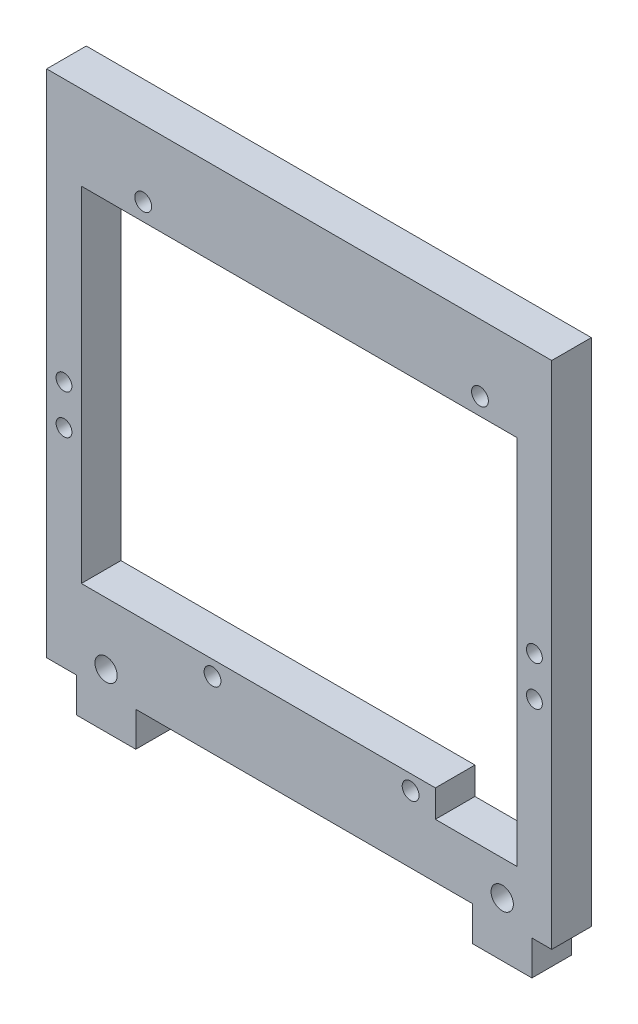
ISO-10303-21;
HEADER;
FILE_DESCRIPTION(('STEP AP214'),'2;1');
FILE_NAME('part.step','',(''),(''),'','','');
FILE_SCHEMA(('AUTOMOTIVE_DESIGN { 1 0 10303 214 1 1 1 1 }'));
ENDSEC;
DATA;
#1=APPLICATION_CONTEXT('core data for automotive mechanical design processes');
#2=APPLICATION_PROTOCOL_DEFINITION('international standard','automotive_design',2000,#1);
#3=PRODUCT_CONTEXT('',#1,'mechanical');
#4=PRODUCT('Part','Part','',(#3));
#5=PRODUCT_RELATED_PRODUCT_CATEGORY('part','',(#4));
#6=PRODUCT_DEFINITION_FORMATION('','',#4);
#7=PRODUCT_DEFINITION_CONTEXT('part definition',#1,'design');
#8=PRODUCT_DEFINITION('design','',#6,#7);
#9=PRODUCT_DEFINITION_SHAPE('','',#8);
#10=(LENGTH_UNIT() NAMED_UNIT(*) SI_UNIT(.MILLI.,.METRE.));
#11=(NAMED_UNIT(*) PLANE_ANGLE_UNIT() SI_UNIT($,.RADIAN.));
#12=(NAMED_UNIT(*) SI_UNIT($,.STERADIAN.) SOLID_ANGLE_UNIT());
#13=UNCERTAINTY_MEASURE_WITH_UNIT(LENGTH_MEASURE(1.E-05),#10,'distance_accuracy_value','');
#14=(GEOMETRIC_REPRESENTATION_CONTEXT(3) GLOBAL_UNCERTAINTY_ASSIGNED_CONTEXT((#13)) GLOBAL_UNIT_ASSIGNED_CONTEXT((#10,
#11,#12)) REPRESENTATION_CONTEXT('',''));
#15=CARTESIAN_POINT('',(0.,0.,0.));
#16=DIRECTION('',(0.,0.,1.));
#17=DIRECTION('',(1.,0.,0.));
#18=AXIS2_PLACEMENT_3D('',#15,#16,#17);
#19=CARTESIAN_POINT('',(0.,0.,8.));
#20=DIRECTION('',(0.,0.,1.));
#21=DIRECTION('',(1.,0.,0.));
#22=AXIS2_PLACEMENT_3D('',#19,#20,#21);
#23=PLANE('',#22);
#24=CARTESIAN_POINT('',(46.5,-15.,8.));
#25=DIRECTION('',(0.,0.,1.));
#26=DIRECTION('',(1.,0.,0.));
#27=AXIS2_PLACEMENT_3D('',#24,#25,#26);
#28=CIRCLE('',#27,1.6);
#29=CARTESIAN_POINT('',(48.1,-15.,8.));
#30=VERTEX_POINT('',#29);
#31=EDGE_CURVE('E642',#30,#30,#28,.T.);
#32=ORIENTED_EDGE('',*,*,#31,.F.);
#33=EDGE_LOOP('',(#32));
#34=FACE_BOUND('',#33,.T.);
#35=CARTESIAN_POINT('',(-48.5,-15.,8.));
#36=DIRECTION('',(0.,0.,1.));
#37=DIRECTION('',(1.,0.,0.));
#38=AXIS2_PLACEMENT_3D('',#35,#36,#37);
#39=CIRCLE('',#38,1.6);
#40=CARTESIAN_POINT('',(-46.9,-15.,8.));
#41=VERTEX_POINT('',#40);
#42=EDGE_CURVE('E654',#41,#41,#39,.T.);
#43=ORIENTED_EDGE('',*,*,#42,.F.);
#44=EDGE_LOOP('',(#43));
#45=FACE_BOUND('',#44,.T.);
#46=CARTESIAN_POINT('',(-40.,-53.,8.));
#47=DIRECTION('',(0.,0.,1.));
#48=DIRECTION('',(1.,0.,0.));
#49=AXIS2_PLACEMENT_3D('',#46,#47,#48);
#50=CIRCLE('',#49,2.25);
#51=CARTESIAN_POINT('',(-37.75,-53.,8.));
#52=VERTEX_POINT('',#51);
#53=EDGE_CURVE('E666',#52,#52,#50,.T.);
#54=ORIENTED_EDGE('',*,*,#53,.F.);
#55=EDGE_LOOP('',(#54));
#56=FACE_BOUND('',#55,.T.);
#57=CARTESIAN_POINT('',(-18.5,-43.5,8.));
#58=DIRECTION('',(0.,0.,1.));
#59=DIRECTION('',(1.,0.,0.));
#60=AXIS2_PLACEMENT_3D('',#57,#58,#59);
#61=CIRCLE('',#60,1.7);
#62=CARTESIAN_POINT('',(-16.8,-43.5,8.));
#63=VERTEX_POINT('',#62);
#64=EDGE_CURVE('E678',#63,#63,#61,.T.);
#65=ORIENTED_EDGE('',*,*,#64,.F.);
#66=EDGE_LOOP('',(#65));
#67=FACE_BOUND('',#66,.T.);
#68=CARTESIAN_POINT('',(-32.5,32.5,8.));
#69=DIRECTION('',(0.,0.,1.));
#70=DIRECTION('',(1.,0.,0.));
#71=AXIS2_PLACEMENT_3D('',#68,#69,#70);
#72=CIRCLE('',#71,1.7);
#73=CARTESIAN_POINT('',(-30.8,32.5,8.));
#74=VERTEX_POINT('',#73);
#75=EDGE_CURVE('E202',#74,#74,#72,.T.);
#76=ORIENTED_EDGE('',*,*,#75,.F.);
#77=EDGE_LOOP('',(#76));
#78=FACE_BOUND('',#77,.T.);
#79=DIRECTION('',(0.,-1.,0.));
#80=VECTOR('',#79,1.);
#81=CARTESIAN_POINT('',(-52.,46.,8.));
#82=LINE('',#81,#80);
#83=CARTESIAN_POINT('',(-52.,46.,8.));
#84=VERTEX_POINT('',#83);
#85=CARTESIAN_POINT('',(-52.,-57.,8.));
#86=VERTEX_POINT('',#85);
#87=EDGE_CURVE('E222',#84,#86,#82,.T.);
#88=ORIENTED_EDGE('',*,*,#87,.T.);
#89=DIRECTION('',(1.,0.,0.));
#90=VECTOR('',#89,1.);
#91=CARTESIAN_POINT('',(-52.,-57.,8.));
#92=LINE('',#91,#90);
#93=CARTESIAN_POINT('',(-46.,-57.,8.));
#94=VERTEX_POINT('',#93);
#95=EDGE_CURVE('E225',#86,#94,#92,.T.);
#96=ORIENTED_EDGE('',*,*,#95,.T.);
#97=DIRECTION('',(0.,-1.,0.));
#98=VECTOR('',#97,1.);
#99=CARTESIAN_POINT('',(-46.,-57.,8.));
#100=LINE('',#99,#98);
#101=CARTESIAN_POINT('',(-46.,-64.,8.));
#102=VERTEX_POINT('',#101);
#103=EDGE_CURVE('E228',#94,#102,#100,.T.);
#104=ORIENTED_EDGE('',*,*,#103,.T.);
#105=DIRECTION('',(1.,0.,0.));
#106=VECTOR('',#105,1.);
#107=CARTESIAN_POINT('',(-46.,-64.,8.));
#108=LINE('',#107,#106);
#109=CARTESIAN_POINT('',(-34.,-64.,8.));
#110=VERTEX_POINT('',#109);
#111=EDGE_CURVE('E230',#102,#110,#108,.T.);
#112=ORIENTED_EDGE('',*,*,#111,.T.);
#113=DIRECTION('',(0.,1.,0.));
#114=VECTOR('',#113,1.);
#115=CARTESIAN_POINT('',(-34.,-64.,8.));
#116=LINE('',#115,#114);
#117=CARTESIAN_POINT('',(-34.,-57.,8.));
#118=VERTEX_POINT('',#117);
#119=EDGE_CURVE('E232',#110,#118,#116,.T.);
#120=ORIENTED_EDGE('',*,*,#119,.T.);
#121=DIRECTION('',(1.,0.,0.));
#122=VECTOR('',#121,1.);
#123=CARTESIAN_POINT('',(-34.,-57.,8.));
#124=LINE('',#123,#122);
#125=CARTESIAN_POINT('',(34.,-57.,8.));
#126=VERTEX_POINT('',#125);
#127=EDGE_CURVE('E234',#118,#126,#124,.T.);
#128=ORIENTED_EDGE('',*,*,#127,.T.);
#129=DIRECTION('',(0.,-1.,0.));
#130=VECTOR('',#129,1.);
#131=CARTESIAN_POINT('',(34.,-57.,8.));
#132=LINE('',#131,#130);
#133=CARTESIAN_POINT('',(34.,-64.,8.));
#134=VERTEX_POINT('',#133);
#135=EDGE_CURVE('E236',#126,#134,#132,.T.);
#136=ORIENTED_EDGE('',*,*,#135,.T.);
#137=DIRECTION('',(1.,0.,0.));
#138=VECTOR('',#137,1.);
#139=CARTESIAN_POINT('',(34.,-64.,8.));
#140=LINE('',#139,#138);
#141=CARTESIAN_POINT('',(46.,-64.,8.));
#142=VERTEX_POINT('',#141);
#143=EDGE_CURVE('E238',#134,#142,#140,.T.);
#144=ORIENTED_EDGE('',*,*,#143,.T.);
#145=DIRECTION('',(0.,1.,0.));
#146=VECTOR('',#145,1.);
#147=CARTESIAN_POINT('',(46.,-64.,8.));
#148=LINE('',#147,#146);
#149=CARTESIAN_POINT('',(46.,-57.,8.));
#150=VERTEX_POINT('',#149);
#151=EDGE_CURVE('E240',#142,#150,#148,.T.);
#152=ORIENTED_EDGE('',*,*,#151,.T.);
#153=DIRECTION('',(1.,0.,0.));
#154=VECTOR('',#153,1.);
#155=CARTESIAN_POINT('',(46.,-57.,8.));
#156=LINE('',#155,#154);
#157=CARTESIAN_POINT('',(50.,-57.,8.));
#158=VERTEX_POINT('',#157);
#159=EDGE_CURVE('E242',#150,#158,#156,.T.);
#160=ORIENTED_EDGE('',*,*,#159,.T.);
#161=DIRECTION('',(0.,1.,0.));
#162=VECTOR('',#161,1.);
#163=CARTESIAN_POINT('',(50.,-57.,8.));
#164=LINE('',#163,#162);
#165=CARTESIAN_POINT('',(50.,46.,8.));
#166=VERTEX_POINT('',#165);
#167=EDGE_CURVE('E244',#158,#166,#164,.T.);
#168=ORIENTED_EDGE('',*,*,#167,.T.);
#169=DIRECTION('',(-1.,0.,0.));
#170=VECTOR('',#169,1.);
#171=CARTESIAN_POINT('',(50.,46.,8.));
#172=LINE('',#171,#170);
#173=EDGE_CURVE('E246',#166,#84,#172,.T.);
#174=ORIENTED_EDGE('',*,*,#173,.T.);
#175=EDGE_LOOP('',(#88,#96,#104,#112,#120,#128,#136,#144,#152,#160,#168,#174));
#176=FACE_BOUND('',#175,.T.);
#177=DIRECTION('',(1.,0.,0.));
#178=VECTOR('',#177,1.);
#179=CARTESIAN_POINT('',(-45.,-40.5,8.));
#180=LINE('',#179,#178);
#181=CARTESIAN_POINT('',(-45.,-40.5,8.));
#182=VERTEX_POINT('',#181);
#183=CARTESIAN_POINT('',(26.5,-40.5,8.));
#184=VERTEX_POINT('',#183);
#185=EDGE_CURVE('E176',#182,#184,#180,.T.);
#186=ORIENTED_EDGE('',*,*,#185,.F.);
#187=DIRECTION('',(0.,-1.,0.));
#188=VECTOR('',#187,1.);
#189=CARTESIAN_POINT('',(-45.,29.,8.));
#190=LINE('',#189,#188);
#191=CARTESIAN_POINT('',(-45.,29.,8.));
#192=VERTEX_POINT('',#191);
#193=EDGE_CURVE('E168',#192,#182,#190,.T.);
#194=ORIENTED_EDGE('',*,*,#193,.F.);
#195=DIRECTION('',(-1.,0.,0.));
#196=VECTOR('',#195,1.);
#197=CARTESIAN_POINT('',(43.,29.,8.));
#198=LINE('',#197,#196);
#199=CARTESIAN_POINT('',(43.,29.,8.));
#200=VERTEX_POINT('',#199);
#201=EDGE_CURVE('E199',#200,#192,#198,.T.);
#202=ORIENTED_EDGE('',*,*,#201,.F.);
#203=DIRECTION('',(0.,1.,0.));
#204=VECTOR('',#203,1.);
#205=CARTESIAN_POINT('',(43.,-46.,8.));
#206=LINE('',#205,#204);
#207=CARTESIAN_POINT('',(43.,-46.,8.));
#208=VERTEX_POINT('',#207);
#209=EDGE_CURVE('E197',#208,#200,#206,.T.);
#210=ORIENTED_EDGE('',*,*,#209,.F.);
#211=DIRECTION('',(1.,0.,0.));
#212=VECTOR('',#211,1.);
#213=CARTESIAN_POINT('',(26.5,-46.,8.));
#214=LINE('',#213,#212);
#215=CARTESIAN_POINT('',(26.5,-46.,8.));
#216=VERTEX_POINT('',#215);
#217=EDGE_CURVE('E192',#216,#208,#214,.T.);
#218=ORIENTED_EDGE('',*,*,#217,.F.);
#219=DIRECTION('',(0.,-1.,0.));
#220=VECTOR('',#219,1.);
#221=CARTESIAN_POINT('',(26.5,-40.5,8.));
#222=LINE('',#221,#220);
#223=EDGE_CURVE('E190',#184,#216,#222,.T.);
#224=ORIENTED_EDGE('',*,*,#223,.F.);
#225=EDGE_LOOP('',(#186,#194,#202,#210,#218,#224));
#226=FACE_BOUND('',#225,.T.);
#227=CARTESIAN_POINT('',(35.5,32.5,8.));
#228=DIRECTION('',(0.,0.,1.));
#229=DIRECTION('',(1.,0.,0.));
#230=AXIS2_PLACEMENT_3D('',#227,#228,#229);
#231=CIRCLE('',#230,1.7);
#232=CARTESIAN_POINT('',(37.2,32.5,8.));
#233=VERTEX_POINT('',#232);
#234=EDGE_CURVE('E684',#233,#233,#231,.T.);
#235=ORIENTED_EDGE('',*,*,#234,.F.);
#236=EDGE_LOOP('',(#235));
#237=FACE_BOUND('',#236,.T.);
#238=CARTESIAN_POINT('',(21.5,-43.5,8.));
#239=DIRECTION('',(0.,0.,1.));
#240=DIRECTION('',(1.,0.,0.));
#241=AXIS2_PLACEMENT_3D('',#238,#239,#240);
#242=CIRCLE('',#241,1.7);
#243=CARTESIAN_POINT('',(23.2,-43.5,8.));
#244=VERTEX_POINT('',#243);
#245=EDGE_CURVE('E672',#244,#244,#242,.T.);
#246=ORIENTED_EDGE('',*,*,#245,.F.);
#247=EDGE_LOOP('',(#246));
#248=FACE_BOUND('',#247,.T.);
#249=CARTESIAN_POINT('',(40.,-53.,8.));
#250=DIRECTION('',(0.,0.,1.));
#251=DIRECTION('',(1.,0.,0.));
#252=AXIS2_PLACEMENT_3D('',#249,#250,#251);
#253=CIRCLE('',#252,2.25);
#254=CARTESIAN_POINT('',(42.25,-53.,8.));
#255=VERTEX_POINT('',#254);
#256=EDGE_CURVE('E660',#255,#255,#253,.T.);
#257=ORIENTED_EDGE('',*,*,#256,.F.);
#258=EDGE_LOOP('',(#257));
#259=FACE_BOUND('',#258,.T.);
#260=CARTESIAN_POINT('',(-48.5,-7.,8.));
#261=DIRECTION('',(0.,0.,1.));
#262=DIRECTION('',(1.,0.,0.));
#263=AXIS2_PLACEMENT_3D('',#260,#261,#262);
#264=CIRCLE('',#263,1.6);
#265=CARTESIAN_POINT('',(-46.9,-7.,8.));
#266=VERTEX_POINT('',#265);
#267=EDGE_CURVE('E648',#266,#266,#264,.T.);
#268=ORIENTED_EDGE('',*,*,#267,.F.);
#269=EDGE_LOOP('',(#268));
#270=FACE_BOUND('',#269,.T.);
#271=CARTESIAN_POINT('',(46.5,-7.,8.));
#272=DIRECTION('',(0.,0.,1.));
#273=DIRECTION('',(1.,0.,0.));
#274=AXIS2_PLACEMENT_3D('',#271,#272,#273);
#275=CIRCLE('',#274,1.6);
#276=CARTESIAN_POINT('',(48.1,-7.,8.));
#277=VERTEX_POINT('',#276);
#278=EDGE_CURVE('E633',#277,#277,#275,.T.);
#279=ORIENTED_EDGE('',*,*,#278,.F.);
#280=EDGE_LOOP('',(#279));
#281=FACE_BOUND('',#280,.T.);
#282=ADVANCED_FACE('F43',(#34,#45,#56,#67,#78,#176,#226,#237,#248,#259,#270,#281),#23,.T.);
#283=CARTESIAN_POINT('',(0.,0.,0.));
#284=DIRECTION('',(0.,0.,1.));
#285=DIRECTION('',(1.,0.,0.));
#286=AXIS2_PLACEMENT_3D('',#283,#284,#285);
#287=PLANE('',#286);
#288=DIRECTION('',(0.,-1.,0.));
#289=VECTOR('',#288,1.);
#290=CARTESIAN_POINT('',(-52.,46.,0.));
#291=LINE('',#290,#289);
#292=CARTESIAN_POINT('',(-52.,46.,0.));
#293=VERTEX_POINT('',#292);
#294=CARTESIAN_POINT('',(-52.,-57.,0.));
#295=VERTEX_POINT('',#294);
#296=EDGE_CURVE('E184',#293,#295,#291,.T.);
#297=ORIENTED_EDGE('',*,*,#296,.F.);
#298=DIRECTION('',(-1.,0.,0.));
#299=VECTOR('',#298,1.);
#300=CARTESIAN_POINT('',(50.,46.,0.));
#301=LINE('',#300,#299);
#302=CARTESIAN_POINT('',(50.,46.,0.));
#303=VERTEX_POINT('',#302);
#304=EDGE_CURVE('E226',#303,#293,#301,.T.);
#305=ORIENTED_EDGE('',*,*,#304,.F.);
#306=DIRECTION('',(0.,1.,0.));
#307=VECTOR('',#306,1.);
#308=CARTESIAN_POINT('',(50.,-57.,0.));
#309=LINE('',#308,#307);
#310=CARTESIAN_POINT('',(50.,-57.,0.));
#311=VERTEX_POINT('',#310);
#312=EDGE_CURVE('E269',#311,#303,#309,.T.);
#313=ORIENTED_EDGE('',*,*,#312,.F.);
#314=DIRECTION('',(1.,0.,0.));
#315=VECTOR('',#314,1.);
#316=CARTESIAN_POINT('',(46.,-57.,0.));
#317=LINE('',#316,#315);
#318=CARTESIAN_POINT('',(46.,-57.,0.));
#319=VERTEX_POINT('',#318);
#320=EDGE_CURVE('E267',#319,#311,#317,.T.);
#321=ORIENTED_EDGE('',*,*,#320,.F.);
#322=DIRECTION('',(0.,1.,0.));
#323=VECTOR('',#322,1.);
#324=CARTESIAN_POINT('',(46.,-64.,0.));
#325=LINE('',#324,#323);
#326=CARTESIAN_POINT('',(46.,-64.,0.));
#327=VERTEX_POINT('',#326);
#328=EDGE_CURVE('E265',#327,#319,#325,.T.);
#329=ORIENTED_EDGE('',*,*,#328,.F.);
#330=DIRECTION('',(1.,0.,0.));
#331=VECTOR('',#330,1.);
#332=CARTESIAN_POINT('',(34.,-64.,0.));
#333=LINE('',#332,#331);
#334=CARTESIAN_POINT('',(34.,-64.,0.));
#335=VERTEX_POINT('',#334);
#336=EDGE_CURVE('E263',#335,#327,#333,.T.);
#337=ORIENTED_EDGE('',*,*,#336,.F.);
#338=DIRECTION('',(0.,-1.,0.));
#339=VECTOR('',#338,1.);
#340=CARTESIAN_POINT('',(34.,-57.,0.));
#341=LINE('',#340,#339);
#342=CARTESIAN_POINT('',(34.,-57.,0.));
#343=VERTEX_POINT('',#342);
#344=EDGE_CURVE('E261',#343,#335,#341,.T.);
#345=ORIENTED_EDGE('',*,*,#344,.F.);
#346=DIRECTION('',(1.,0.,0.));
#347=VECTOR('',#346,1.);
#348=CARTESIAN_POINT('',(-34.,-57.,0.));
#349=LINE('',#348,#347);
#350=CARTESIAN_POINT('',(-34.,-57.,0.));
#351=VERTEX_POINT('',#350);
#352=EDGE_CURVE('E259',#351,#343,#349,.T.);
#353=ORIENTED_EDGE('',*,*,#352,.F.);
#354=DIRECTION('',(0.,1.,0.));
#355=VECTOR('',#354,1.);
#356=CARTESIAN_POINT('',(-34.,-64.,0.));
#357=LINE('',#356,#355);
#358=CARTESIAN_POINT('',(-34.,-64.,0.));
#359=VERTEX_POINT('',#358);
#360=EDGE_CURVE('E257',#359,#351,#357,.T.);
#361=ORIENTED_EDGE('',*,*,#360,.F.);
#362=DIRECTION('',(1.,0.,0.));
#363=VECTOR('',#362,1.);
#364=CARTESIAN_POINT('',(-46.,-64.,0.));
#365=LINE('',#364,#363);
#366=CARTESIAN_POINT('',(-46.,-64.,0.));
#367=VERTEX_POINT('',#366);
#368=EDGE_CURVE('E255',#367,#359,#365,.T.);
#369=ORIENTED_EDGE('',*,*,#368,.F.);
#370=DIRECTION('',(0.,-1.,0.));
#371=VECTOR('',#370,1.);
#372=CARTESIAN_POINT('',(-46.,-57.,0.));
#373=LINE('',#372,#371);
#374=CARTESIAN_POINT('',(-46.,-57.,0.));
#375=VERTEX_POINT('',#374);
#376=EDGE_CURVE('E253',#375,#367,#373,.T.);
#377=ORIENTED_EDGE('',*,*,#376,.F.);
#378=DIRECTION('',(1.,0.,0.));
#379=VECTOR('',#378,1.);
#380=CARTESIAN_POINT('',(-52.,-57.,0.));
#381=LINE('',#380,#379);
#382=EDGE_CURVE('E251',#295,#375,#381,.T.);
#383=ORIENTED_EDGE('',*,*,#382,.F.);
#384=EDGE_LOOP('',(#297,#305,#313,#321,#329,#337,#345,#353,#361,#369,#377,#383));
#385=FACE_BOUND('',#384,.T.);
#386=DIRECTION('',(0.,-1.,0.));
#387=VECTOR('',#386,1.);
#388=CARTESIAN_POINT('',(-45.,29.,0.));
#389=LINE('',#388,#387);
#390=CARTESIAN_POINT('',(-45.,29.,0.));
#391=VERTEX_POINT('',#390);
#392=CARTESIAN_POINT('',(-45.,-40.5,0.));
#393=VERTEX_POINT('',#392);
#394=EDGE_CURVE('E66',#391,#393,#389,.T.);
#395=ORIENTED_EDGE('',*,*,#394,.T.);
#396=DIRECTION('',(1.,0.,0.));
#397=VECTOR('',#396,1.);
#398=CARTESIAN_POINT('',(-45.,-40.5,0.));
#399=LINE('',#398,#397);
#400=CARTESIAN_POINT('',(26.5,-40.5,0.));
#401=VERTEX_POINT('',#400);
#402=EDGE_CURVE('E183',#393,#401,#399,.T.);
#403=ORIENTED_EDGE('',*,*,#402,.T.);
#404=DIRECTION('',(0.,-1.,0.));
#405=VECTOR('',#404,1.);
#406=CARTESIAN_POINT('',(26.5,-40.5,0.));
#407=LINE('',#406,#405);
#408=CARTESIAN_POINT('',(26.5,-46.,0.));
#409=VERTEX_POINT('',#408);
#410=EDGE_CURVE('E204',#401,#409,#407,.T.);
#411=ORIENTED_EDGE('',*,*,#410,.T.);
#412=DIRECTION('',(1.,0.,0.));
#413=VECTOR('',#412,1.);
#414=CARTESIAN_POINT('',(26.5,-46.,0.));
#415=LINE('',#414,#413);
#416=CARTESIAN_POINT('',(43.,-46.,0.));
#417=VERTEX_POINT('',#416);
#418=EDGE_CURVE('E207',#409,#417,#415,.T.);
#419=ORIENTED_EDGE('',*,*,#418,.T.);
#420=DIRECTION('',(0.,1.,0.));
#421=VECTOR('',#420,1.);
#422=CARTESIAN_POINT('',(43.,-46.,0.));
#423=LINE('',#422,#421);
#424=CARTESIAN_POINT('',(43.,29.,0.));
#425=VERTEX_POINT('',#424);
#426=EDGE_CURVE('E210',#417,#425,#423,.T.);
#427=ORIENTED_EDGE('',*,*,#426,.T.);
#428=DIRECTION('',(-1.,0.,0.));
#429=VECTOR('',#428,1.);
#430=CARTESIAN_POINT('',(43.,29.,0.));
#431=LINE('',#430,#429);
#432=EDGE_CURVE('E177',#425,#391,#431,.T.);
#433=ORIENTED_EDGE('',*,*,#432,.T.);
#434=EDGE_LOOP('',(#395,#403,#411,#419,#427,#433));
#435=FACE_BOUND('',#434,.T.);
#436=CARTESIAN_POINT('',(-32.5,32.5,0.));
#437=DIRECTION('',(0.,0.,1.));
#438=DIRECTION('',(1.,0.,0.));
#439=AXIS2_PLACEMENT_3D('',#436,#437,#438);
#440=CIRCLE('',#439,1.7);
#441=CARTESIAN_POINT('',(-30.8,32.5,0.));
#442=VERTEX_POINT('',#441);
#443=EDGE_CURVE('E687',#442,#442,#440,.T.);
#444=ORIENTED_EDGE('',*,*,#443,.T.);
#445=EDGE_LOOP('',(#444));
#446=FACE_BOUND('',#445,.T.);
#447=CARTESIAN_POINT('',(35.5,32.5,0.));
#448=DIRECTION('',(0.,0.,1.));
#449=DIRECTION('',(1.,0.,0.));
#450=AXIS2_PLACEMENT_3D('',#447,#448,#449);
#451=CIRCLE('',#450,1.7);
#452=CARTESIAN_POINT('',(37.2,32.5,0.));
#453=VERTEX_POINT('',#452);
#454=EDGE_CURVE('E681',#453,#453,#451,.T.);
#455=ORIENTED_EDGE('',*,*,#454,.T.);
#456=EDGE_LOOP('',(#455));
#457=FACE_BOUND('',#456,.T.);
#458=CARTESIAN_POINT('',(-18.5,-43.5,0.));
#459=DIRECTION('',(0.,0.,1.));
#460=DIRECTION('',(1.,0.,0.));
#461=AXIS2_PLACEMENT_3D('',#458,#459,#460);
#462=CIRCLE('',#461,1.7);
#463=CARTESIAN_POINT('',(-16.8,-43.5,0.));
#464=VERTEX_POINT('',#463);
#465=EDGE_CURVE('E675',#464,#464,#462,.T.);
#466=ORIENTED_EDGE('',*,*,#465,.T.);
#467=EDGE_LOOP('',(#466));
#468=FACE_BOUND('',#467,.T.);
#469=CARTESIAN_POINT('',(21.5,-43.5,0.));
#470=DIRECTION('',(0.,0.,1.));
#471=DIRECTION('',(1.,0.,0.));
#472=AXIS2_PLACEMENT_3D('',#469,#470,#471);
#473=CIRCLE('',#472,1.7);
#474=CARTESIAN_POINT('',(23.2,-43.5,0.));
#475=VERTEX_POINT('',#474);
#476=EDGE_CURVE('E669',#475,#475,#473,.T.);
#477=ORIENTED_EDGE('',*,*,#476,.T.);
#478=EDGE_LOOP('',(#477));
#479=FACE_BOUND('',#478,.T.);
#480=CARTESIAN_POINT('',(-40.,-53.,0.));
#481=DIRECTION('',(0.,0.,1.));
#482=DIRECTION('',(1.,0.,0.));
#483=AXIS2_PLACEMENT_3D('',#480,#481,#482);
#484=CIRCLE('',#483,2.25);
#485=CARTESIAN_POINT('',(-37.75,-53.,0.));
#486=VERTEX_POINT('',#485);
#487=EDGE_CURVE('E663',#486,#486,#484,.T.);
#488=ORIENTED_EDGE('',*,*,#487,.T.);
#489=EDGE_LOOP('',(#488));
#490=FACE_BOUND('',#489,.T.);
#491=CARTESIAN_POINT('',(40.,-53.,0.));
#492=DIRECTION('',(0.,0.,1.));
#493=DIRECTION('',(1.,0.,0.));
#494=AXIS2_PLACEMENT_3D('',#491,#492,#493);
#495=CIRCLE('',#494,2.25);
#496=CARTESIAN_POINT('',(42.25,-53.,0.));
#497=VERTEX_POINT('',#496);
#498=EDGE_CURVE('E657',#497,#497,#495,.T.);
#499=ORIENTED_EDGE('',*,*,#498,.T.);
#500=EDGE_LOOP('',(#499));
#501=FACE_BOUND('',#500,.T.);
#502=CARTESIAN_POINT('',(-48.5,-15.,0.));
#503=DIRECTION('',(0.,0.,1.));
#504=DIRECTION('',(1.,0.,0.));
#505=AXIS2_PLACEMENT_3D('',#502,#503,#504);
#506=CIRCLE('',#505,1.6);
#507=CARTESIAN_POINT('',(-46.9,-15.,0.));
#508=VERTEX_POINT('',#507);
#509=EDGE_CURVE('E651',#508,#508,#506,.T.);
#510=ORIENTED_EDGE('',*,*,#509,.T.);
#511=EDGE_LOOP('',(#510));
#512=FACE_BOUND('',#511,.T.);
#513=CARTESIAN_POINT('',(-48.5,-7.,0.));
#514=DIRECTION('',(0.,0.,1.));
#515=DIRECTION('',(1.,0.,0.));
#516=AXIS2_PLACEMENT_3D('',#513,#514,#515);
#517=CIRCLE('',#516,1.6);
#518=CARTESIAN_POINT('',(-46.9,-7.,0.));
#519=VERTEX_POINT('',#518);
#520=EDGE_CURVE('E645',#519,#519,#517,.T.);
#521=ORIENTED_EDGE('',*,*,#520,.T.);
#522=EDGE_LOOP('',(#521));
#523=FACE_BOUND('',#522,.T.);
#524=CARTESIAN_POINT('',(46.5,-15.,0.));
#525=DIRECTION('',(0.,0.,1.));
#526=DIRECTION('',(1.,0.,0.));
#527=AXIS2_PLACEMENT_3D('',#524,#525,#526);
#528=CIRCLE('',#527,1.6);
#529=CARTESIAN_POINT('',(48.1,-15.,0.));
#530=VERTEX_POINT('',#529);
#531=EDGE_CURVE('E639',#530,#530,#528,.T.);
#532=ORIENTED_EDGE('',*,*,#531,.T.);
#533=EDGE_LOOP('',(#532));
#534=FACE_BOUND('',#533,.T.);
#535=CARTESIAN_POINT('',(46.5,-7.,0.));
#536=DIRECTION('',(0.,0.,1.));
#537=DIRECTION('',(1.,0.,0.));
#538=AXIS2_PLACEMENT_3D('',#535,#536,#537);
#539=CIRCLE('',#538,1.6);
#540=CARTESIAN_POINT('',(48.1,-7.,0.));
#541=VERTEX_POINT('',#540);
#542=EDGE_CURVE('E636',#541,#541,#539,.T.);
#543=ORIENTED_EDGE('',*,*,#542,.T.);
#544=EDGE_LOOP('',(#543));
#545=FACE_BOUND('',#544,.T.);
#546=ADVANCED_FACE('F311',(#385,#435,#446,#457,#468,#479,#490,#501,#512,#523,#534,#545),#287,.F.);
#547=CARTESIAN_POINT('',(-52.,46.,8.));
#548=DIRECTION('',(1.,0.,0.));
#549=DIRECTION('',(0.,0.,-1.));
#550=AXIS2_PLACEMENT_3D('',#547,#548,#549);
#551=PLANE('',#550);
#552=ORIENTED_EDGE('',*,*,#296,.T.);
#553=DIRECTION('',(0.,0.,-1.));
#554=VECTOR('',#553,1.);
#555=CARTESIAN_POINT('',(-52.,-57.,8.));
#556=LINE('',#555,#554);
#557=EDGE_CURVE('E11',#86,#295,#556,.T.);
#558=ORIENTED_EDGE('',*,*,#557,.F.);
#559=ORIENTED_EDGE('',*,*,#87,.F.);
#560=DIRECTION('',(0.,0.,-1.));
#561=VECTOR('',#560,1.);
#562=CARTESIAN_POINT('',(-52.,46.,8.));
#563=LINE('',#562,#561);
#564=EDGE_CURVE('E248',#84,#293,#563,.T.);
#565=ORIENTED_EDGE('',*,*,#564,.T.);
#566=EDGE_LOOP('',(#552,#558,#559,#565));
#567=FACE_BOUND('',#566,.T.);
#568=ADVANCED_FACE('F45',(#567),#551,.F.);
#569=CARTESIAN_POINT('',(-52.,-57.,8.));
#570=DIRECTION('',(0.,1.,0.));
#571=DIRECTION('',(0.,0.,1.));
#572=AXIS2_PLACEMENT_3D('',#569,#570,#571);
#573=PLANE('',#572);
#574=ORIENTED_EDGE('',*,*,#382,.T.);
#575=DIRECTION('',(0.,0.,-1.));
#576=VECTOR('',#575,1.);
#577=CARTESIAN_POINT('',(-46.,-57.,8.));
#578=LINE('',#577,#576);
#579=EDGE_CURVE('E51',#94,#375,#578,.T.);
#580=ORIENTED_EDGE('',*,*,#579,.F.);
#581=ORIENTED_EDGE('',*,*,#95,.F.);
#582=ORIENTED_EDGE('',*,*,#557,.T.);
#583=EDGE_LOOP('',(#574,#580,#581,#582));
#584=FACE_BOUND('',#583,.T.);
#585=ADVANCED_FACE('F328',(#584),#573,.F.);
#586=CARTESIAN_POINT('',(-46.,-57.,8.));
#587=DIRECTION('',(1.,0.,0.));
#588=DIRECTION('',(0.,0.,-1.));
#589=AXIS2_PLACEMENT_3D('',#586,#587,#588);
#590=PLANE('',#589);
#591=ORIENTED_EDGE('',*,*,#376,.T.);
#592=DIRECTION('',(0.,0.,-1.));
#593=VECTOR('',#592,1.);
#594=CARTESIAN_POINT('',(-46.,-64.,8.));
#595=LINE('',#594,#593);
#596=EDGE_CURVE('E298',#102,#367,#595,.T.);
#597=ORIENTED_EDGE('',*,*,#596,.F.);
#598=ORIENTED_EDGE('',*,*,#103,.F.);
#599=ORIENTED_EDGE('',*,*,#579,.T.);
#600=EDGE_LOOP('',(#591,#597,#598,#599));
#601=FACE_BOUND('',#600,.T.);
#602=ADVANCED_FACE('F305',(#601),#590,.F.);
#603=CARTESIAN_POINT('',(-46.,-64.,8.));
#604=DIRECTION('',(0.,1.,0.));
#605=DIRECTION('',(0.,0.,1.));
#606=AXIS2_PLACEMENT_3D('',#603,#604,#605);
#607=PLANE('',#606);
#608=ORIENTED_EDGE('',*,*,#368,.T.);
#609=DIRECTION('',(0.,0.,-1.));
#610=VECTOR('',#609,1.);
#611=CARTESIAN_POINT('',(-34.,-64.,8.));
#612=LINE('',#611,#610);
#613=EDGE_CURVE('E295',#110,#359,#612,.T.);
#614=ORIENTED_EDGE('',*,*,#613,.F.);
#615=ORIENTED_EDGE('',*,*,#111,.F.);
#616=ORIENTED_EDGE('',*,*,#596,.T.);
#617=EDGE_LOOP('',(#608,#614,#615,#616));
#618=FACE_BOUND('',#617,.T.);
#619=ADVANCED_FACE('F317',(#618),#607,.F.);
#620=CARTESIAN_POINT('',(-34.,-64.,8.));
#621=DIRECTION('',(-1.,0.,0.));
#622=DIRECTION('',(0.,0.,1.));
#623=AXIS2_PLACEMENT_3D('',#620,#621,#622);
#624=PLANE('',#623);
#625=ORIENTED_EDGE('',*,*,#360,.T.);
#626=DIRECTION('',(0.,0.,-1.));
#627=VECTOR('',#626,1.);
#628=CARTESIAN_POINT('',(-34.,-57.,8.));
#629=LINE('',#628,#627);
#630=EDGE_CURVE('E292',#118,#351,#629,.T.);
#631=ORIENTED_EDGE('',*,*,#630,.F.);
#632=ORIENTED_EDGE('',*,*,#119,.F.);
#633=ORIENTED_EDGE('',*,*,#613,.T.);
#634=EDGE_LOOP('',(#625,#631,#632,#633));
#635=FACE_BOUND('',#634,.T.);
#636=ADVANCED_FACE('F321',(#635),#624,.F.);
#637=CARTESIAN_POINT('',(-34.,-57.,8.));
#638=DIRECTION('',(0.,1.,0.));
#639=DIRECTION('',(0.,0.,1.));
#640=AXIS2_PLACEMENT_3D('',#637,#638,#639);
#641=PLANE('',#640);
#642=ORIENTED_EDGE('',*,*,#352,.T.);
#643=DIRECTION('',(0.,0.,-1.));
#644=VECTOR('',#643,1.);
#645=CARTESIAN_POINT('',(34.,-57.,8.));
#646=LINE('',#645,#644);
#647=EDGE_CURVE('E289',#126,#343,#646,.T.);
#648=ORIENTED_EDGE('',*,*,#647,.F.);
#649=ORIENTED_EDGE('',*,*,#127,.F.);
#650=ORIENTED_EDGE('',*,*,#630,.T.);
#651=EDGE_LOOP('',(#642,#648,#649,#650));
#652=FACE_BOUND('',#651,.T.);
#653=ADVANCED_FACE('F361',(#652),#641,.F.);
#654=CARTESIAN_POINT('',(34.,-57.,8.));
#655=DIRECTION('',(1.,0.,0.));
#656=DIRECTION('',(0.,0.,-1.));
#657=AXIS2_PLACEMENT_3D('',#654,#655,#656);
#658=PLANE('',#657);
#659=ORIENTED_EDGE('',*,*,#344,.T.);
#660=DIRECTION('',(0.,0.,-1.));
#661=VECTOR('',#660,1.);
#662=CARTESIAN_POINT('',(34.,-64.,8.));
#663=LINE('',#662,#661);
#664=EDGE_CURVE('E286',#134,#335,#663,.T.);
#665=ORIENTED_EDGE('',*,*,#664,.F.);
#666=ORIENTED_EDGE('',*,*,#135,.F.);
#667=ORIENTED_EDGE('',*,*,#647,.T.);
#668=EDGE_LOOP('',(#659,#665,#666,#667));
#669=FACE_BOUND('',#668,.T.);
#670=ADVANCED_FACE('F359',(#669),#658,.F.);
#671=CARTESIAN_POINT('',(34.,-64.,8.));
#672=DIRECTION('',(0.,1.,0.));
#673=DIRECTION('',(0.,0.,1.));
#674=AXIS2_PLACEMENT_3D('',#671,#672,#673);
#675=PLANE('',#674);
#676=ORIENTED_EDGE('',*,*,#336,.T.);
#677=DIRECTION('',(0.,0.,-1.));
#678=VECTOR('',#677,1.);
#679=CARTESIAN_POINT('',(46.,-64.,8.));
#680=LINE('',#679,#678);
#681=EDGE_CURVE('E283',#142,#327,#680,.T.);
#682=ORIENTED_EDGE('',*,*,#681,.F.);
#683=ORIENTED_EDGE('',*,*,#143,.F.);
#684=ORIENTED_EDGE('',*,*,#664,.T.);
#685=EDGE_LOOP('',(#676,#682,#683,#684));
#686=FACE_BOUND('',#685,.T.);
#687=ADVANCED_FACE('F355',(#686),#675,.F.);
#688=CARTESIAN_POINT('',(46.,-64.,8.));
#689=DIRECTION('',(-1.,0.,0.));
#690=DIRECTION('',(0.,0.,1.));
#691=AXIS2_PLACEMENT_3D('',#688,#689,#690);
#692=PLANE('',#691);
#693=ORIENTED_EDGE('',*,*,#328,.T.);
#694=DIRECTION('',(0.,0.,-1.));
#695=VECTOR('',#694,1.);
#696=CARTESIAN_POINT('',(46.,-57.,8.));
#697=LINE('',#696,#695);
#698=EDGE_CURVE('E280',#150,#319,#697,.T.);
#699=ORIENTED_EDGE('',*,*,#698,.F.);
#700=ORIENTED_EDGE('',*,*,#151,.F.);
#701=ORIENTED_EDGE('',*,*,#681,.T.);
#702=EDGE_LOOP('',(#693,#699,#700,#701));
#703=FACE_BOUND('',#702,.T.);
#704=ADVANCED_FACE('F350',(#703),#692,.F.);
#705=CARTESIAN_POINT('',(46.,-57.,8.));
#706=DIRECTION('',(0.,1.,0.));
#707=DIRECTION('',(0.,0.,1.));
#708=AXIS2_PLACEMENT_3D('',#705,#706,#707);
#709=PLANE('',#708);
#710=ORIENTED_EDGE('',*,*,#320,.T.);
#711=DIRECTION('',(0.,0.,-1.));
#712=VECTOR('',#711,1.);
#713=CARTESIAN_POINT('',(50.,-57.,8.));
#714=LINE('',#713,#712);
#715=EDGE_CURVE('E277',#158,#311,#714,.T.);
#716=ORIENTED_EDGE('',*,*,#715,.F.);
#717=ORIENTED_EDGE('',*,*,#159,.F.);
#718=ORIENTED_EDGE('',*,*,#698,.T.);
#719=EDGE_LOOP('',(#710,#716,#717,#718));
#720=FACE_BOUND('',#719,.T.);
#721=ADVANCED_FACE('F344',(#720),#709,.F.);
#722=CARTESIAN_POINT('',(50.,-57.,8.));
#723=DIRECTION('',(-1.,0.,0.));
#724=DIRECTION('',(0.,0.,1.));
#725=AXIS2_PLACEMENT_3D('',#722,#723,#724);
#726=PLANE('',#725);
#727=ORIENTED_EDGE('',*,*,#312,.T.);
#728=DIRECTION('',(0.,0.,-1.));
#729=VECTOR('',#728,1.);
#730=CARTESIAN_POINT('',(50.,46.,8.));
#731=LINE('',#730,#729);
#732=EDGE_CURVE('E274',#166,#303,#731,.T.);
#733=ORIENTED_EDGE('',*,*,#732,.F.);
#734=ORIENTED_EDGE('',*,*,#167,.F.);
#735=ORIENTED_EDGE('',*,*,#715,.T.);
#736=EDGE_LOOP('',(#727,#733,#734,#735));
#737=FACE_BOUND('',#736,.T.);
#738=ADVANCED_FACE('F340',(#737),#726,.F.);
#739=CARTESIAN_POINT('',(50.,46.,8.));
#740=DIRECTION('',(0.,-1.,0.));
#741=DIRECTION('',(0.,0.,-1.));
#742=AXIS2_PLACEMENT_3D('',#739,#740,#741);
#743=PLANE('',#742);
#744=ORIENTED_EDGE('',*,*,#304,.T.);
#745=ORIENTED_EDGE('',*,*,#564,.F.);
#746=ORIENTED_EDGE('',*,*,#173,.F.);
#747=ORIENTED_EDGE('',*,*,#732,.T.);
#748=EDGE_LOOP('',(#744,#745,#746,#747));
#749=FACE_BOUND('',#748,.T.);
#750=ADVANCED_FACE('F335',(#749),#743,.F.);
#751=CARTESIAN_POINT('',(-45.,29.,8.));
#752=DIRECTION('',(1.,0.,0.));
#753=DIRECTION('',(0.,0.,-1.));
#754=AXIS2_PLACEMENT_3D('',#751,#752,#753);
#755=PLANE('',#754);
#756=ORIENTED_EDGE('',*,*,#394,.F.);
#757=DIRECTION('',(0.,0.,-1.));
#758=VECTOR('',#757,1.);
#759=CARTESIAN_POINT('',(-45.,29.,8.));
#760=LINE('',#759,#758);
#761=EDGE_CURVE('E172',#192,#391,#760,.T.);
#762=ORIENTED_EDGE('',*,*,#761,.F.);
#763=ORIENTED_EDGE('',*,*,#193,.T.);
#764=DIRECTION('',(0.,0.,-1.));
#765=VECTOR('',#764,1.);
#766=CARTESIAN_POINT('',(-45.,-40.5,8.));
#767=LINE('',#766,#765);
#768=EDGE_CURVE('E171',#182,#393,#767,.T.);
#769=ORIENTED_EDGE('',*,*,#768,.T.);
#770=EDGE_LOOP('',(#756,#762,#763,#769));
#771=FACE_BOUND('',#770,.T.);
#772=ADVANCED_FACE('F170',(#771),#755,.T.);
#773=CARTESIAN_POINT('',(-45.,-40.5,8.));
#774=DIRECTION('',(0.,1.,0.));
#775=DIRECTION('',(0.,0.,1.));
#776=AXIS2_PLACEMENT_3D('',#773,#774,#775);
#777=PLANE('',#776);
#778=ORIENTED_EDGE('',*,*,#402,.F.);
#779=ORIENTED_EDGE('',*,*,#768,.F.);
#780=ORIENTED_EDGE('',*,*,#185,.T.);
#781=DIRECTION('',(0.,0.,-1.));
#782=VECTOR('',#781,1.);
#783=CARTESIAN_POINT('',(26.5,-40.5,8.));
#784=LINE('',#783,#782);
#785=EDGE_CURVE('E185',#184,#401,#784,.T.);
#786=ORIENTED_EDGE('',*,*,#785,.T.);
#787=EDGE_LOOP('',(#778,#779,#780,#786));
#788=FACE_BOUND('',#787,.T.);
#789=ADVANCED_FACE('F180',(#788),#777,.T.);
#790=CARTESIAN_POINT('',(26.5,-40.5,8.));
#791=DIRECTION('',(1.,0.,0.));
#792=DIRECTION('',(0.,0.,-1.));
#793=AXIS2_PLACEMENT_3D('',#790,#791,#792);
#794=PLANE('',#793);
#795=ORIENTED_EDGE('',*,*,#410,.F.);
#796=ORIENTED_EDGE('',*,*,#785,.F.);
#797=ORIENTED_EDGE('',*,*,#223,.T.);
#798=DIRECTION('',(0.,0.,-1.));
#799=VECTOR('',#798,1.);
#800=CARTESIAN_POINT('',(26.5,-46.,8.));
#801=LINE('',#800,#799);
#802=EDGE_CURVE('E219',#216,#409,#801,.T.);
#803=ORIENTED_EDGE('',*,*,#802,.T.);
#804=EDGE_LOOP('',(#795,#796,#797,#803));
#805=FACE_BOUND('',#804,.T.);
#806=ADVANCED_FACE('F428',(#805),#794,.T.);
#807=CARTESIAN_POINT('',(26.5,-46.,8.));
#808=DIRECTION('',(0.,1.,0.));
#809=DIRECTION('',(0.,0.,1.));
#810=AXIS2_PLACEMENT_3D('',#807,#808,#809);
#811=PLANE('',#810);
#812=ORIENTED_EDGE('',*,*,#418,.F.);
#813=ORIENTED_EDGE('',*,*,#802,.F.);
#814=ORIENTED_EDGE('',*,*,#217,.T.);
#815=DIRECTION('',(0.,0.,-1.));
#816=VECTOR('',#815,1.);
#817=CARTESIAN_POINT('',(43.,-46.,8.));
#818=LINE('',#817,#816);
#819=EDGE_CURVE('E217',#208,#417,#818,.T.);
#820=ORIENTED_EDGE('',*,*,#819,.T.);
#821=EDGE_LOOP('',(#812,#813,#814,#820));
#822=FACE_BOUND('',#821,.T.);
#823=ADVANCED_FACE('F435',(#822),#811,.T.);
#824=CARTESIAN_POINT('',(43.,-46.,8.));
#825=DIRECTION('',(-1.,0.,0.));
#826=DIRECTION('',(0.,0.,1.));
#827=AXIS2_PLACEMENT_3D('',#824,#825,#826);
#828=PLANE('',#827);
#829=ORIENTED_EDGE('',*,*,#426,.F.);
#830=ORIENTED_EDGE('',*,*,#819,.F.);
#831=ORIENTED_EDGE('',*,*,#209,.T.);
#832=DIRECTION('',(0.,0.,-1.));
#833=VECTOR('',#832,1.);
#834=CARTESIAN_POINT('',(43.,29.,8.));
#835=LINE('',#834,#833);
#836=EDGE_CURVE('E58',#200,#425,#835,.T.);
#837=ORIENTED_EDGE('',*,*,#836,.T.);
#838=EDGE_LOOP('',(#829,#830,#831,#837));
#839=FACE_BOUND('',#838,.T.);
#840=ADVANCED_FACE('F444',(#839),#828,.T.);
#841=CARTESIAN_POINT('',(43.,29.,8.));
#842=DIRECTION('',(0.,-1.,0.));
#843=DIRECTION('',(0.,0.,-1.));
#844=AXIS2_PLACEMENT_3D('',#841,#842,#843);
#845=PLANE('',#844);
#846=ORIENTED_EDGE('',*,*,#432,.F.);
#847=ORIENTED_EDGE('',*,*,#836,.F.);
#848=ORIENTED_EDGE('',*,*,#201,.T.);
#849=ORIENTED_EDGE('',*,*,#761,.T.);
#850=EDGE_LOOP('',(#846,#847,#848,#849));
#851=FACE_BOUND('',#850,.T.);
#852=ADVANCED_FACE('F453',(#851),#845,.T.);
#853=CARTESIAN_POINT('',(-32.5,32.5,8.));
#854=DIRECTION('',(0.,0.,-1.));
#855=DIRECTION('',(-1.,0.,0.));
#856=AXIS2_PLACEMENT_3D('',#853,#854,#855);
#857=CYLINDRICAL_SURFACE('',#856,1.7);
#858=ORIENTED_EDGE('',*,*,#75,.T.);
#859=EDGE_LOOP('',(#858));
#860=FACE_BOUND('',#859,.T.);
#861=ORIENTED_EDGE('',*,*,#443,.F.);
#862=EDGE_LOOP('',(#861));
#863=FACE_BOUND('',#862,.T.);
#864=ADVANCED_FACE('F462',(#860,#863),#857,.F.);
#865=CARTESIAN_POINT('',(35.5,32.5,8.));
#866=DIRECTION('',(0.,0.,-1.));
#867=DIRECTION('',(-1.,0.,0.));
#868=AXIS2_PLACEMENT_3D('',#865,#866,#867);
#869=CYLINDRICAL_SURFACE('',#868,1.7);
#870=ORIENTED_EDGE('',*,*,#234,.T.);
#871=EDGE_LOOP('',(#870));
#872=FACE_BOUND('',#871,.T.);
#873=ORIENTED_EDGE('',*,*,#454,.F.);
#874=EDGE_LOOP('',(#873));
#875=FACE_BOUND('',#874,.T.);
#876=ADVANCED_FACE('F470',(#872,#875),#869,.F.);
#877=CARTESIAN_POINT('',(-18.5,-43.5,8.));
#878=DIRECTION('',(0.,0.,-1.));
#879=DIRECTION('',(-1.,0.,0.));
#880=AXIS2_PLACEMENT_3D('',#877,#878,#879);
#881=CYLINDRICAL_SURFACE('',#880,1.7);
#882=ORIENTED_EDGE('',*,*,#64,.T.);
#883=EDGE_LOOP('',(#882));
#884=FACE_BOUND('',#883,.T.);
#885=ORIENTED_EDGE('',*,*,#465,.F.);
#886=EDGE_LOOP('',(#885));
#887=FACE_BOUND('',#886,.T.);
#888=ADVANCED_FACE('F479',(#884,#887),#881,.F.);
#889=CARTESIAN_POINT('',(21.5,-43.5,8.));
#890=DIRECTION('',(0.,0.,-1.));
#891=DIRECTION('',(-1.,0.,0.));
#892=AXIS2_PLACEMENT_3D('',#889,#890,#891);
#893=CYLINDRICAL_SURFACE('',#892,1.7);
#894=ORIENTED_EDGE('',*,*,#245,.T.);
#895=EDGE_LOOP('',(#894));
#896=FACE_BOUND('',#895,.T.);
#897=ORIENTED_EDGE('',*,*,#476,.F.);
#898=EDGE_LOOP('',(#897));
#899=FACE_BOUND('',#898,.T.);
#900=ADVANCED_FACE('F488',(#896,#899),#893,.F.);
#901=CARTESIAN_POINT('',(-40.,-53.,8.));
#902=DIRECTION('',(0.,0.,-1.));
#903=DIRECTION('',(-1.,0.,0.));
#904=AXIS2_PLACEMENT_3D('',#901,#902,#903);
#905=CYLINDRICAL_SURFACE('',#904,2.25);
#906=ORIENTED_EDGE('',*,*,#53,.T.);
#907=EDGE_LOOP('',(#906));
#908=FACE_BOUND('',#907,.T.);
#909=ORIENTED_EDGE('',*,*,#487,.F.);
#910=EDGE_LOOP('',(#909));
#911=FACE_BOUND('',#910,.T.);
#912=ADVANCED_FACE('F497',(#908,#911),#905,.F.);
#913=CARTESIAN_POINT('',(40.,-53.,8.));
#914=DIRECTION('',(0.,0.,-1.));
#915=DIRECTION('',(-1.,0.,0.));
#916=AXIS2_PLACEMENT_3D('',#913,#914,#915);
#917=CYLINDRICAL_SURFACE('',#916,2.25);
#918=ORIENTED_EDGE('',*,*,#256,.T.);
#919=EDGE_LOOP('',(#918));
#920=FACE_BOUND('',#919,.T.);
#921=ORIENTED_EDGE('',*,*,#498,.F.);
#922=EDGE_LOOP('',(#921));
#923=FACE_BOUND('',#922,.T.);
#924=ADVANCED_FACE('F506',(#920,#923),#917,.F.);
#925=CARTESIAN_POINT('',(-48.5,-15.,8.));
#926=DIRECTION('',(0.,0.,-1.));
#927=DIRECTION('',(-1.,0.,0.));
#928=AXIS2_PLACEMENT_3D('',#925,#926,#927);
#929=CYLINDRICAL_SURFACE('',#928,1.6);
#930=ORIENTED_EDGE('',*,*,#42,.T.);
#931=EDGE_LOOP('',(#930));
#932=FACE_BOUND('',#931,.T.);
#933=ORIENTED_EDGE('',*,*,#509,.F.);
#934=EDGE_LOOP('',(#933));
#935=FACE_BOUND('',#934,.T.);
#936=ADVANCED_FACE('F515',(#932,#935),#929,.F.);
#937=CARTESIAN_POINT('',(-48.5,-7.,8.));
#938=DIRECTION('',(0.,0.,-1.));
#939=DIRECTION('',(-1.,0.,0.));
#940=AXIS2_PLACEMENT_3D('',#937,#938,#939);
#941=CYLINDRICAL_SURFACE('',#940,1.6);
#942=ORIENTED_EDGE('',*,*,#267,.T.);
#943=EDGE_LOOP('',(#942));
#944=FACE_BOUND('',#943,.T.);
#945=ORIENTED_EDGE('',*,*,#520,.F.);
#946=EDGE_LOOP('',(#945));
#947=FACE_BOUND('',#946,.T.);
#948=ADVANCED_FACE('F524',(#944,#947),#941,.F.);
#949=CARTESIAN_POINT('',(46.5,-15.,8.));
#950=DIRECTION('',(0.,0.,-1.));
#951=DIRECTION('',(-1.,0.,0.));
#952=AXIS2_PLACEMENT_3D('',#949,#950,#951);
#953=CYLINDRICAL_SURFACE('',#952,1.6);
#954=ORIENTED_EDGE('',*,*,#31,.T.);
#955=EDGE_LOOP('',(#954));
#956=FACE_BOUND('',#955,.T.);
#957=ORIENTED_EDGE('',*,*,#531,.F.);
#958=EDGE_LOOP('',(#957));
#959=FACE_BOUND('',#958,.T.);
#960=ADVANCED_FACE('F533',(#956,#959),#953,.F.);
#961=CARTESIAN_POINT('',(46.5,-7.,8.));
#962=DIRECTION('',(0.,0.,-1.));
#963=DIRECTION('',(-1.,0.,0.));
#964=AXIS2_PLACEMENT_3D('',#961,#962,#963);
#965=CYLINDRICAL_SURFACE('',#964,1.6);
#966=ORIENTED_EDGE('',*,*,#278,.T.);
#967=EDGE_LOOP('',(#966));
#968=FACE_BOUND('',#967,.T.);
#969=ORIENTED_EDGE('',*,*,#542,.F.);
#970=EDGE_LOOP('',(#969));
#971=FACE_BOUND('',#970,.T.);
#972=ADVANCED_FACE('F542',(#968,#971),#965,.F.);
#973=CLOSED_SHELL('',(#282,#546,#568,#585,#602,#619,#636,#653,#670,#687,#704,#721,#738,#750,
#772,#789,#806,#823,#840,#852,#864,#876,#888,#900,#912,#924,#936,#948,#960,#972));
#974=MANIFOLD_SOLID_BREP('B2',#973);
#975=ADVANCED_BREP_SHAPE_REPRESENTATION('',(#18,#974),#14);
#976=SHAPE_DEFINITION_REPRESENTATION(#9,#975);
ENDSEC;
END-ISO-10303-21;
